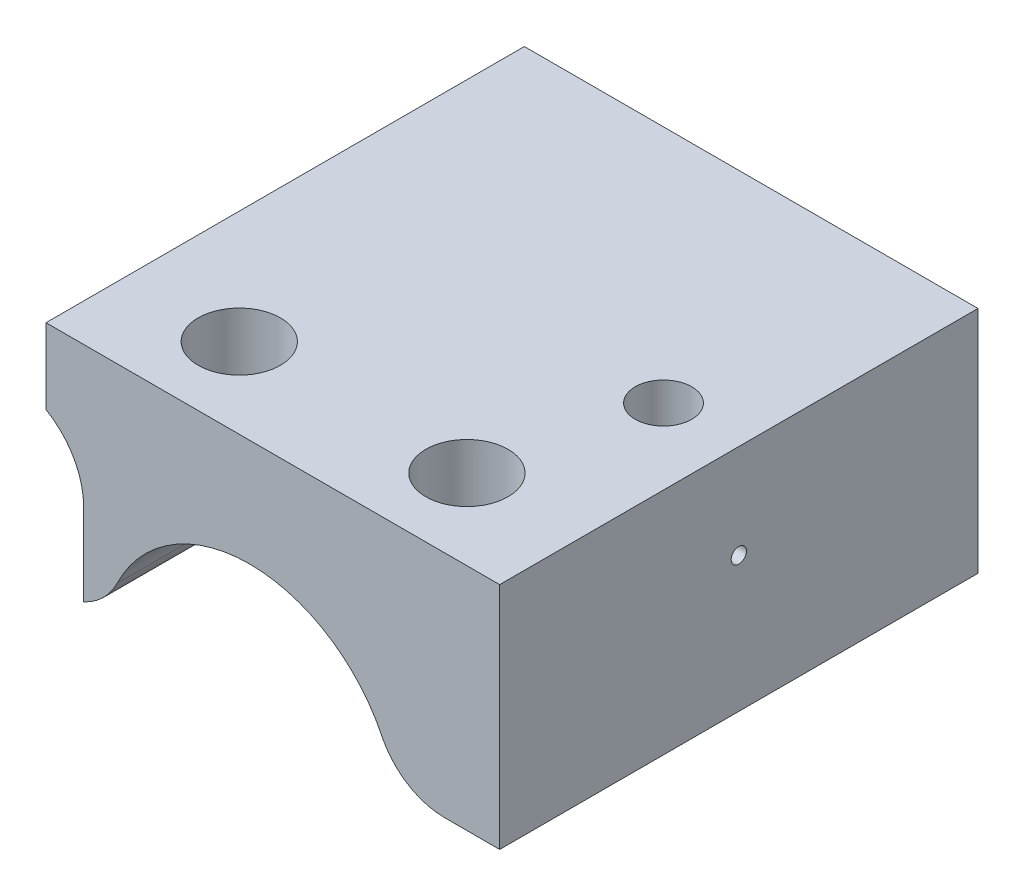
from build123d import *

# Parameters (mm, degrees)
EXTRUDE1_DEPTH                  = 6.35
SKETCH21_R                      = 0.75
CUT_EXTRUDE5_DEPTH              = 3
F_78_0_016_DIAMETER_HOLE1_D     = 0.4064
F_78_0_016_DIAMETER_HOLE1_DEPTH = 3
F_78_0_016_DIAMETER_HOLE1_TIP   = 0.122094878
SKETCH32_R                      = 1.0922
CUT_EXTRUDE9_DEPTH              = 12.023621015


with BuildPart() as part:
    # Sketch17 → Extrude1 (new, symmetric)
    with BuildSketch(Plane.XY):
        with BuildLine():
            Line((5.178795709, 0.66), (6.64150728, 0.66))
            Line((6.64150728, 0.66), (6.64150728, 6.75))
            Line((6.64150728, 6.75), (-5.40299272, 6.75))
            Line((-5.40299272, 6.75), (-5.40299272, 4.75))
            ThreePointArc((-5.40299272, 4.75), (-4.670941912, 4.017949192), (-4.40299272, 3.017949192))
            Line((-4.40299272, 3.017949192), (-4.40299272, 0.830526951))
            ThreePointArc((-4.40299272, 0.830526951), (-3.882853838, 1.189759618), (-3.51402211, 1.703136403))
            ThreePointArc((-3.51402211, 1.703136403), (0, 3.905), (3.51402211, 1.703136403))
            ThreePointArc((3.51402211, 1.703136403), (4.196501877, 0.942326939), (5.178795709, 0.66))
        make_face()
    extrude(amount=EXTRUDE1_DEPTH, both=True)

    # Sketch21 → Cut-Extrude5 (cut)
    with BuildSketch(Plane(origin=(0, 6.75, 0), x_dir=(1, 0, 0), z_dir=(0, 1, 0))):
        with Locations(Location((4.64150728, 0, 0), (0, 0, 180))):
            Circle(SKETCH21_R)
    extrude(amount=-CUT_EXTRUDE5_DEPTH, mode=Mode.SUBTRACT)

    # Sketch29 → Cut-Revolve1 (revolve, cut)
    with BuildSketch(Plane.XY, mode=Mode.PRIVATE) as cut_revolve1_sk:
        Polygon((5.39150728, 3.75), (4.64150728, 3.299354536), (4.64150728, 3.75), align=None)
    revolve(cut_revolve1_sk.sketch.rotate(Axis((4.64150728, 3.75, 0), (0, -1, 0)), 90), axis=Axis((4.64150728, 3.75, 0), (0, -1, 0)), mode=Mode.SUBTRACT)

    # 78 _0.016_ Diameter Hole1
    with Locations(Plane(origin=(6.64150728, 0, 0), x_dir=(0, 0, -1), z_dir=(1, 0, 0))):
        with Locations((0, 4.25)):
            Hole(F_78_0_016_DIAMETER_HOLE1_D / 2, depth=F_78_0_016_DIAMETER_HOLE1_DEPTH)
            with Locations((0, 0, -(F_78_0_016_DIAMETER_HOLE1_DEPTH + F_78_0_016_DIAMETER_HOLE1_TIP / 2))):  # 118° drill point
                Cone(0, F_78_0_016_DIAMETER_HOLE1_D / 2, F_78_0_016_DIAMETER_HOLE1_TIP, mode=Mode.SUBTRACT)

    # Sketch32 → Cut-Extrude9 (cut, through all)
    with BuildSketch(Plane(origin=(0, 6.75, 0), x_dir=(1, 0, 0), z_dir=(0, 1, 0))):
        with Locations(Location((-2.40295607, -4.21875, 0), (0, 0, 180))):
            Circle(SKETCH32_R)
        with Locations(Location((3.64147063, -4.21875, 0), (0, 0, 96.701094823))):
            Circle(SKETCH32_R)
    extrude(amount=-CUT_EXTRUDE9_DEPTH, mode=Mode.SUBTRACT)


solid = part.part
